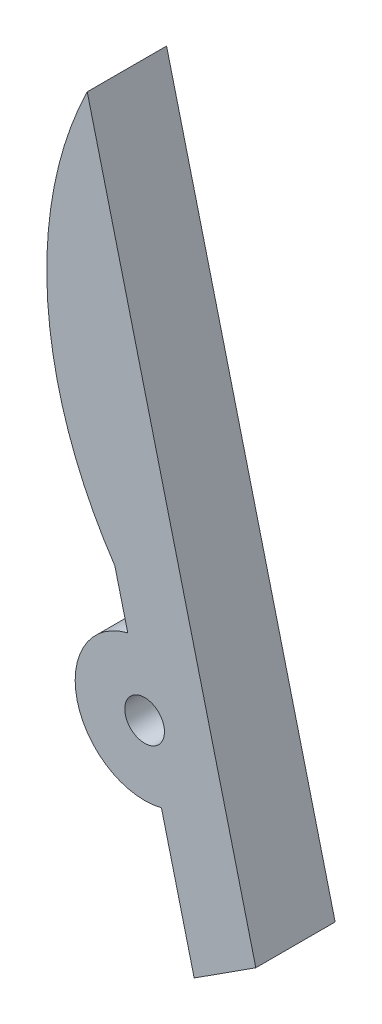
from build123d import *

# Parameters (mm, degrees)
SKETCH_1_R      = 1
EXTRUDE_1_DEPTH = 4


with BuildPart() as part:
    # Sketch 1 → Extrude 1 (new body)
    with BuildSketch(Plane.XY):
        with BuildLine():
            Line((4.5, 33), (2.848874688, 39.604501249))
            ThreePointArc((2.848874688, 39.604501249), (-1.395498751, 42.151125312), (1.151125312, 46.395498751))
            Line((1.151125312, 46.395498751), (0.5, 49))
            ThreePointArc((0.5, 49), (-2.883125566, 58.81294793), (-0.892282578, 69))
            Line((-0.892282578, 69), (7.607717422, 35))
            Line((7.607717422, 35), (4.5, 33))
        make_face()
        with Locations((2, 43)):
            Circle(SKETCH_1_R, mode=Mode.SUBTRACT)
    extrude(amount=EXTRUDE_1_DEPTH)


solid = part.part
